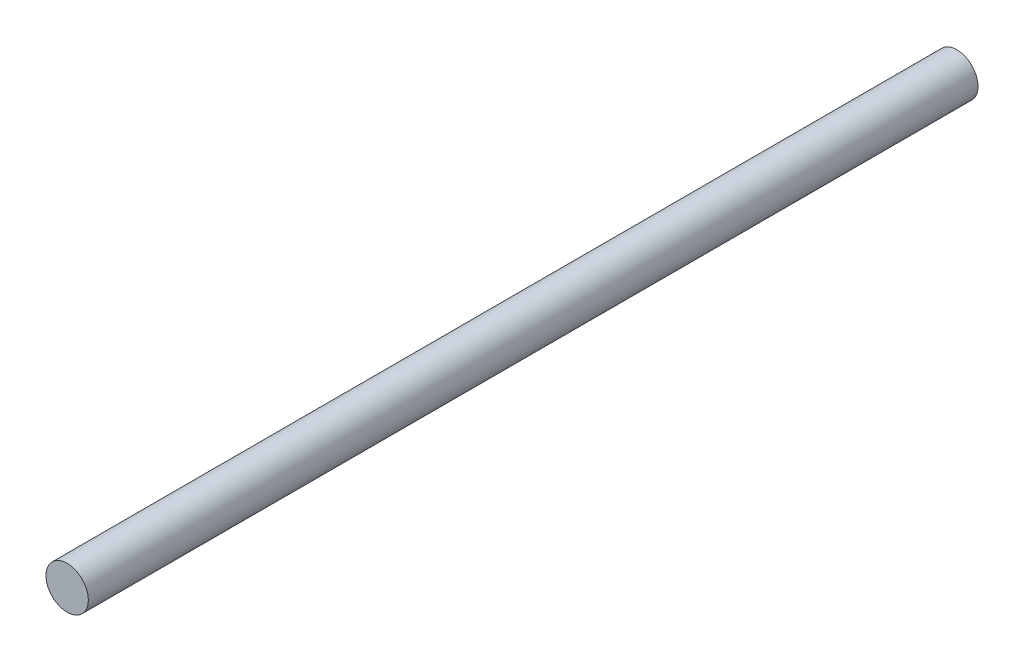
from build123d import *

# Parameters (mm, degrees)
ESQUISSE1_R        = 1.5
BOSS_EXTRU_1_DEPTH = 63


with BuildPart() as part:
    # Esquisse1 → Boss.-Extru.1 (new body)
    with BuildSketch(Plane.XY):
        Circle(ESQUISSE1_R)
    extrude(amount=BOSS_EXTRU_1_DEPTH)


solid = part.part
